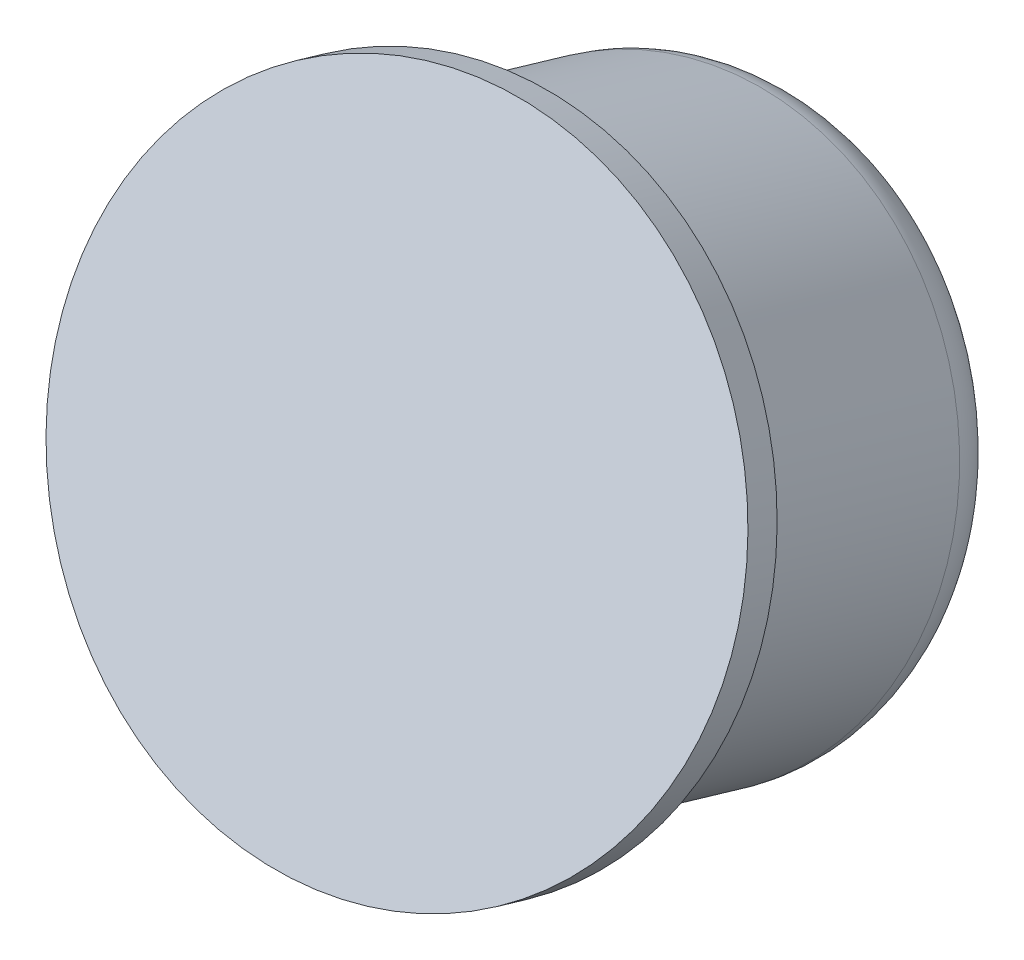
ISO-10303-21;
HEADER;
FILE_DESCRIPTION(('STEP AP214'),'2;1');
FILE_NAME('part.step','',(''),(''),'','','');
FILE_SCHEMA(('AUTOMOTIVE_DESIGN { 1 0 10303 214 1 1 1 1 }'));
ENDSEC;
DATA;
#1=APPLICATION_CONTEXT('core data for automotive mechanical design processes');
#2=APPLICATION_PROTOCOL_DEFINITION('international standard','automotive_design',2000,#1);
#3=PRODUCT_CONTEXT('',#1,'mechanical');
#4=PRODUCT('Part','Part','',(#3));
#5=PRODUCT_RELATED_PRODUCT_CATEGORY('part','',(#4));
#6=PRODUCT_DEFINITION_FORMATION('','',#4);
#7=PRODUCT_DEFINITION_CONTEXT('part definition',#1,'design');
#8=PRODUCT_DEFINITION('design','',#6,#7);
#9=PRODUCT_DEFINITION_SHAPE('','',#8);
#10=(LENGTH_UNIT() NAMED_UNIT(*) SI_UNIT(.MILLI.,.METRE.));
#11=(NAMED_UNIT(*) PLANE_ANGLE_UNIT() SI_UNIT($,.RADIAN.));
#12=(NAMED_UNIT(*) SI_UNIT($,.STERADIAN.) SOLID_ANGLE_UNIT());
#13=UNCERTAINTY_MEASURE_WITH_UNIT(LENGTH_MEASURE(1.E-05),#10,'distance_accuracy_value','');
#14=(GEOMETRIC_REPRESENTATION_CONTEXT(3) GLOBAL_UNCERTAINTY_ASSIGNED_CONTEXT((#13)) GLOBAL_UNIT_ASSIGNED_CONTEXT((#10,
#11,#12)) REPRESENTATION_CONTEXT('',''));
#15=CARTESIAN_POINT('',(0.,0.,0.));
#16=DIRECTION('',(0.,0.,1.));
#17=DIRECTION('',(1.,0.,0.));
#18=AXIS2_PLACEMENT_3D('',#15,#16,#17);
#19=CARTESIAN_POINT('',(-863.385749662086,-322.012171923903,-505.02655231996));
#20=DIRECTION('',(-0.0989674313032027,-0.344641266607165,-0.933502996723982));
#21=DIRECTION('',(0.,0.938108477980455,-0.346341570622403));
#22=AXIS2_PLACEMENT_3D('',#19,#20,#21);
#23=PLANE('',#22);
#24=CARTESIAN_POINT('',(-866.064593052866,-331.504800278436,-501.237952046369));
#25=CARTESIAN_POINT('',(-865.936292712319,-331.541083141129,-501.238158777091));
#26=CARTESIAN_POINT('',(-865.807359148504,-331.575119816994,-501.239261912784));
#27=CARTESIAN_POINT('',(-865.548401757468,-331.638639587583,-501.243264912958));
#28=CARTESIAN_POINT('',(-865.418377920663,-331.66812264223,-501.246164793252));
#29=CARTESIAN_POINT('',(-865.157416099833,-331.722473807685,-501.253765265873));
#30=CARTESIAN_POINT('',(-865.026478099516,-331.747341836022,-501.258465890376));
#31=CARTESIAN_POINT('',(-864.841903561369,-331.779099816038,-501.266309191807));
#32=CARTESIAN_POINT('',(-864.788557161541,-331.787893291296,-501.268718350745));
#33=CARTESIAN_POINT('',(-864.713059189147,-331.799727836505,-501.272353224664));
#34=CARTESIAN_POINT('',(-864.690956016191,-331.803118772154,-501.273444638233));
#35=CARTESIAN_POINT('',(-864.578207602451,-331.820064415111,-501.279141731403));
#36=CARTESIAN_POINT('',(-864.487420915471,-331.832551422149,-501.28415659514));
#37=CARTESIAN_POINT('',(-864.238408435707,-331.863711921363,-501.299052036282));
#38=CARTESIAN_POINT('',(-864.079947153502,-331.880133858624,-501.309788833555));
#39=CARTESIAN_POINT('',(-863.742939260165,-331.907816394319,-501.335297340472));
#40=CARTESIAN_POINT('',(-863.564344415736,-331.918181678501,-501.3504047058));
#41=CARTESIAN_POINT('',(-863.202680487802,-331.930503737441,-501.384198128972));
#42=CARTESIAN_POINT('',(-863.0196114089,-331.932243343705,-501.40296436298));
#43=CARTESIAN_POINT('',(-862.682942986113,-331.927187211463,-501.440523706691));
#44=CARTESIAN_POINT('',(-862.529269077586,-331.921699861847,-501.458841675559));
#45=CARTESIAN_POINT('',(-862.222562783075,-331.904374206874,-501.497754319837));
#46=CARTESIAN_POINT('',(-862.069530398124,-331.892535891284,-501.518348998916));
#47=CARTESIAN_POINT('',(-861.823770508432,-331.86837723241,-501.553322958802));
#48=CARTESIAN_POINT('',(-861.730744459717,-331.85803628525,-501.567003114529));
#49=CARTESIAN_POINT('',(-861.593619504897,-331.841012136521,-501.587825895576));
#50=CARTESIAN_POINT('',(-861.54935718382,-331.83524154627,-501.594648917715));
#51=CARTESIAN_POINT('',(-861.367947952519,-331.8104502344,-501.62303416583));
#52=CARTESIAN_POINT('',(-861.231239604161,-331.789087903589,-501.645414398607));
#53=CARTESIAN_POINT('',(-860.92537071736,-331.735278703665,-501.697707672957));
#54=CARTESIAN_POINT('',(-860.756547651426,-331.701397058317,-501.728114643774));
#55=CARTESIAN_POINT('',(-860.387933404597,-331.61818030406,-501.797917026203));
#56=CARTESIAN_POINT('',(-860.188639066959,-331.567113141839,-501.837899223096));
#57=CARTESIAN_POINT('',(-859.901039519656,-331.48449434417,-501.898891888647));
#58=CARTESIAN_POINT('',(-859.811126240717,-331.457367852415,-501.918439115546));
#59=CARTESIAN_POINT('',(-859.614879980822,-331.395309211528,-501.962156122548));
#60=CARTESIAN_POINT('',(-859.50873906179,-331.359882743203,-501.986488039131));
#61=CARTESIAN_POINT('',(-859.22456009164,-331.259988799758,-502.053495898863));
#62=CARTESIAN_POINT('',(-859.047820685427,-331.19244927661,-502.097168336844));
#63=CARTESIAN_POINT('',(-858.786161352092,-331.084245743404,-502.164856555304));
#64=CARTESIAN_POINT('',(-858.699512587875,-331.047026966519,-502.187783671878));
#65=CARTESIAN_POINT('',(-858.527417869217,-330.970315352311,-502.234349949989));
#66=CARTESIAN_POINT('',(-858.441971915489,-330.93082251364,-502.257989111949));
#67=CARTESIAN_POINT('',(-858.254605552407,-330.841095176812,-502.310979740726));
#68=CARTESIAN_POINT('',(-858.152978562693,-330.790342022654,-502.340491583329));
#69=CARTESIAN_POINT('',(-857.951693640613,-330.685612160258,-502.400496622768));
#70=CARTESIAN_POINT('',(-857.852035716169,-330.631635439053,-502.430989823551));
#71=CARTESIAN_POINT('',(-857.669688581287,-330.528900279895,-502.488250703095));
#72=CARTESIAN_POINT('',(-857.586708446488,-330.480583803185,-502.514886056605));
#73=CARTESIAN_POINT('',(-857.425399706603,-330.383554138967,-502.56781008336));
#74=CARTESIAN_POINT('',(-857.34701331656,-330.33492366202,-502.594074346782));
#75=CARTESIAN_POINT('',(-857.175540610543,-330.225244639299,-502.652745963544));
#76=CARTESIAN_POINT('',(-857.082802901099,-330.163723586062,-502.685290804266));
#77=CARTESIAN_POINT('',(-856.9043587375,-330.041000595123,-502.749517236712));
#78=CARTESIAN_POINT('',(-856.818536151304,-329.979945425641,-502.781156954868));
#79=CARTESIAN_POINT('',(-856.653657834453,-329.858646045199,-502.84341958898));
#80=CARTESIAN_POINT('',(-856.574487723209,-329.798537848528,-502.874004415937));
#81=CARTESIAN_POINT('',(-856.422644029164,-329.679593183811,-502.934015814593));
#82=CARTESIAN_POINT('',(-856.349858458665,-329.62088190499,-502.963408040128));
#83=CARTESIAN_POINT('',(-856.146381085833,-329.451864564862,-503.047379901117));
#84=CARTESIAN_POINT('',(-856.017850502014,-329.339240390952,-503.102586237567));
#85=CARTESIAN_POINT('',(-855.853333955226,-329.187303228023,-503.176121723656));
#86=CARTESIAN_POINT('',(-855.814420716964,-329.150769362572,-503.193735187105));
#87=CARTESIAN_POINT('',(-855.710732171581,-329.051812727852,-503.241261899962));
#88=CARTESIAN_POINT('',(-855.646545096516,-328.988838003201,-503.271316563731));
#89=CARTESIAN_POINT('',(-855.502808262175,-328.843818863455,-503.340094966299));
#90=CARTESIAN_POINT('',(-855.423842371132,-328.761257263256,-503.378947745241));
#91=CARTESIAN_POINT('',(-855.248284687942,-328.571036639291,-503.467787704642));
#92=CARTESIAN_POINT('',(-855.152644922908,-328.462584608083,-503.517966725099));
#93=CARTESIAN_POINT('',(-855.005850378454,-328.288247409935,-503.597893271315));
#94=CARTESIAN_POINT('',(-854.952939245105,-328.223691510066,-503.62733624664));
#95=CARTESIAN_POINT('',(-854.832305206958,-328.072447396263,-503.695963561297));
#96=CARTESIAN_POINT('',(-854.765248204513,-327.985274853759,-503.735256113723));
#97=CARTESIAN_POINT('',(-854.641183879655,-327.818024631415,-503.810156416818));
#98=CARTESIAN_POINT('',(-854.58385985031,-327.738160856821,-503.845718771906));
#99=CARTESIAN_POINT('',(-854.463548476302,-327.564828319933,-503.922466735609));
#100=CARTESIAN_POINT('',(-854.400976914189,-327.471093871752,-503.96370635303));
#101=CARTESIAN_POINT('',(-854.307142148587,-327.324984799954,-504.027596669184));
#102=CARTESIAN_POINT('',(-854.274662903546,-327.273325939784,-504.05011203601));
#103=CARTESIAN_POINT('',(-854.177714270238,-327.115738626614,-504.118570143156));
#104=CARTESIAN_POINT('',(-854.114861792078,-327.008880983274,-504.164684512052));
#105=CARTESIAN_POINT('',(-854.003674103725,-326.810906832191,-504.249562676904));
#106=CARTESIAN_POINT('',(-853.954667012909,-326.72014050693,-504.288268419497));
#107=CARTESIAN_POINT('',(-853.849550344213,-326.517464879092,-504.374238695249));
#108=CARTESIAN_POINT('',(-853.794172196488,-326.40519669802,-504.421558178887));
#109=CARTESIAN_POINT('',(-853.725055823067,-326.257564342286,-504.483390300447));
#110=CARTESIAN_POINT('',(-853.709194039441,-326.22313060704,-504.497784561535));
#111=CARTESIAN_POINT('',(-853.610703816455,-326.00578567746,-504.588468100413));
#112=CARTESIAN_POINT('',(-853.533894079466,-325.820318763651,-504.665084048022));
#113=CARTESIAN_POINT('',(-853.401513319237,-325.468444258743,-504.809027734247));
#114=CARTESIAN_POINT('',(-853.344486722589,-325.302564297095,-504.876314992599));
#115=CARTESIAN_POINT('',(-853.284401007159,-325.110403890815,-504.953629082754));
#116=CARTESIAN_POINT('',(-853.276734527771,-325.085521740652,-504.963628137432));
#117=CARTESIAN_POINT('',(-853.209083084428,-324.862613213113,-505.053096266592));
#118=CARTESIAN_POINT('',(-853.155625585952,-324.662565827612,-505.132619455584));
#119=CARTESIAN_POINT('',(-853.067946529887,-324.283739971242,-505.281774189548));
#120=CARTESIAN_POINT('',(-853.032177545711,-324.10532790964,-505.35143451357));
#121=CARTESIAN_POINT('',(-852.991395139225,-323.865002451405,-505.444484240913));
#122=CARTESIAN_POINT('',(-852.981666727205,-323.80393583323,-505.468060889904));
#123=CARTESIAN_POINT('',(-852.939580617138,-323.521424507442,-505.576823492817));
#124=CARTESIAN_POINT('',(-852.914661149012,-323.298677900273,-505.661701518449));
#125=CARTESIAN_POINT('',(-852.888242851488,-322.946826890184,-505.794402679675));
#126=CARTESIAN_POINT('',(-852.881289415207,-322.818240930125,-505.842612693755));
#127=CARTESIAN_POINT('',(-852.875546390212,-322.648584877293,-505.905857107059));
#128=CARTESIAN_POINT('',(-852.87442359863,-322.607659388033,-505.921085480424));
#129=CARTESIAN_POINT('',(-852.868453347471,-322.320899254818,-506.027587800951));
#130=CARTESIAN_POINT('',(-852.873081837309,-322.074459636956,-506.118080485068));
#131=CARTESIAN_POINT('',(-852.894345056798,-321.708722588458,-506.250853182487));
#132=CARTESIAN_POINT('',(-852.90357870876,-321.589235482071,-506.293987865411));
#133=CARTESIAN_POINT('',(-852.918251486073,-321.43739043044,-506.348492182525));
#134=CARTESIAN_POINT('',(-852.921560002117,-321.404922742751,-506.360128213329));
#135=CARTESIAN_POINT('',(-852.930493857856,-321.321587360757,-506.389947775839));
#136=CARTESIAN_POINT('',(-852.936368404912,-321.270734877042,-506.408099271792));
#137=CARTESIAN_POINT('',(-852.958969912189,-321.088087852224,-506.473134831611));
#138=CARTESIAN_POINT('',(-852.978070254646,-320.956470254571,-506.519701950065));
#139=CARTESIAN_POINT('',(-853.031028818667,-320.638693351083,-506.631407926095));
#140=CARTESIAN_POINT('',(-853.067715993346,-320.452846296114,-506.696131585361));
#141=CARTESIAN_POINT('',(-853.111475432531,-320.260962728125,-506.762334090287));
#142=CARTESIAN_POINT('',(-853.113083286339,-320.253948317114,-506.764753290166));
#143=CARTESIAN_POINT('',(-853.119516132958,-320.226025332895,-506.774380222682));
#144=CARTESIAN_POINT('',(-853.124402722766,-320.205127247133,-506.781577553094));
#145=CARTESIAN_POINT('',(-853.137510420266,-320.149903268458,-506.800576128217));
#146=CARTESIAN_POINT('',(-853.145851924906,-320.115598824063,-506.812356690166));
#147=CARTESIAN_POINT('',(-853.166257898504,-320.033636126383,-506.840453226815));
#148=CARTESIAN_POINT('',(-853.178500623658,-319.986011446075,-506.856737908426));
#149=CARTESIAN_POINT('',(-853.20727073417,-319.877526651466,-506.893739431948));
#150=CARTESIAN_POINT('',(-853.224034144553,-319.816714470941,-506.914413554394));
#151=CARTESIAN_POINT('',(-853.262576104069,-319.682028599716,-506.960052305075));
#152=CARTESIAN_POINT('',(-853.284647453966,-319.608219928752,-506.984961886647));
#153=CARTESIAN_POINT('',(-853.334700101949,-319.447785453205,-507.038886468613));
#154=CARTESIAN_POINT('',(-853.363029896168,-319.361245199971,-507.067832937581));
#155=CARTESIAN_POINT('',(-853.426651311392,-319.175680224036,-507.129596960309));
#156=CARTESIAN_POINT('',(-853.462345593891,-319.076765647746,-507.162331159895));
#157=CARTESIAN_POINT('',(-853.54189539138,-318.866893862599,-507.231380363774));
#158=CARTESIAN_POINT('',(-853.58620574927,-318.756076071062,-507.267595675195));
#159=CARTESIAN_POINT('',(-853.684321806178,-318.522972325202,-507.343253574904));
#160=CARTESIAN_POINT('',(-853.738631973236,-318.40086029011,-507.38257847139));
#161=CARTESIAN_POINT('',(-853.858199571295,-318.145901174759,-507.464030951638));
#162=CARTESIAN_POINT('',(-853.924007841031,-318.013268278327,-507.506021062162));
#163=CARTESIAN_POINT('',(-854.068120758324,-317.738185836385,-507.592300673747));
#164=CARTESIAN_POINT('',(-854.14701863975,-317.595996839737,-507.636431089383));
#165=CARTESIAN_POINT('',(-854.318927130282,-317.302938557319,-507.726400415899));
#166=CARTESIAN_POINT('',(-854.412568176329,-317.152383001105,-507.772056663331));
#167=CARTESIAN_POINT('',(-854.615627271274,-316.843957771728,-507.864396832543));
#168=CARTESIAN_POINT('',(-854.725707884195,-316.686460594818,-507.910872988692));
#169=CARTESIAN_POINT('',(-854.900710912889,-316.450268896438,-507.979519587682));
#170=CARTESIAN_POINT('',(-854.962407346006,-316.369486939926,-508.00280270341));
#171=CARTESIAN_POINT('',(-855.090444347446,-316.206797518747,-508.049292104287));
#172=CARTESIAN_POINT('',(-855.156871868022,-316.124949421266,-508.072467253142));
#173=CARTESIAN_POINT('',(-855.294567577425,-315.960388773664,-508.118623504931));
#174=CARTESIAN_POINT('',(-855.365923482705,-315.877740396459,-508.141571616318));
#175=CARTESIAN_POINT('',(-855.513668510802,-315.711856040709,-508.187151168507));
#176=CARTESIAN_POINT('',(-855.590145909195,-315.628689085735,-508.209747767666));
#177=CARTESIAN_POINT('',(-855.74831688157,-315.46206649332,-508.254494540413));
#178=CARTESIAN_POINT('',(-855.830098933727,-315.378684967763,-508.276607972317));
#179=CARTESIAN_POINT('',(-855.999051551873,-315.211953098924,-508.32025204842));
#180=CARTESIAN_POINT('',(-856.086310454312,-315.128682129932,-508.341744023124));
#181=CARTESIAN_POINT('',(-856.266376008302,-314.962513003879,-508.384002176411));
#182=CARTESIAN_POINT('',(-856.359270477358,-314.879699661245,-508.404727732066));
#183=CARTESIAN_POINT('',(-856.55075106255,-314.714809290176,-508.445303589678));
#184=CARTESIAN_POINT('',(-856.649424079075,-314.632822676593,-508.46511129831));
#185=CARTESIAN_POINT('',(-856.852587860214,-314.469971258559,-508.503695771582));
#186=CARTESIAN_POINT('',(-856.957164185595,-314.389202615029,-508.522427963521));
#187=CARTESIAN_POINT('',(-857.172240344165,-314.229194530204,-508.558699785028));
#188=CARTESIAN_POINT('',(-857.282823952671,-314.15005712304,-508.576192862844));
#189=CARTESIAN_POINT('',(-857.509997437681,-313.993740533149,-508.609819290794));
#190=CARTESIAN_POINT('',(-857.626668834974,-313.916669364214,-508.625904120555));
#191=CARTESIAN_POINT('',(-857.866074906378,-313.764935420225,-508.656541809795));
#192=CARTESIAN_POINT('',(-857.988888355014,-313.690386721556,-508.671044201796));
#193=CARTESIAN_POINT('',(-858.240606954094,-313.544168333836,-508.698340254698));
#194=CARTESIAN_POINT('',(-858.369587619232,-313.472618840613,-508.711081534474));
#195=CARTESIAN_POINT('',(-858.633637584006,-313.332888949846,-508.734674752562));
#196=CARTESIAN_POINT('',(-858.768778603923,-313.264834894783,-508.74547244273));
#197=CARTESIAN_POINT('',(-859.045111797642,-313.132604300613,-508.764994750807));
#198=CARTESIAN_POINT('',(-859.186371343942,-313.068560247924,-508.773663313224));
#199=CARTESIAN_POINT('',(-859.474866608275,-312.944874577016,-508.788741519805));
#200=CARTESIAN_POINT('',(-859.622164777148,-312.885371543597,-508.795093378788));
#201=CARTESIAN_POINT('',(-859.92262225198,-312.771308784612,-508.805350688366));
#202=CARTESIAN_POINT('',(-860.075838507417,-312.716893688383,-508.809196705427));
#203=CARTESIAN_POINT('',(-860.387972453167,-312.613556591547,-508.814256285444));
#204=CARTESIAN_POINT('',(-860.546940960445,-312.564785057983,-508.815408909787));
#205=CARTESIAN_POINT('',(-860.706906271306,-312.51954356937,-508.815152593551));
#206=B_SPLINE_CURVE_WITH_KNOTS('',3,(#24,#25,#26,#27,#28,#29,#30,#31,#32,#33,#34,#35,#36,#37,
#38,#39,#40,#41,#42,#43,#44,#45,#46,#47,#48,#49,#50,#51,#52,#53,#54,#55,#56,#57,#58,#59,#60,#61,
#62,#63,#64,#65,#66,#67,#68,#69,#70,#71,#72,#73,#74,#75,#76,#77,#78,#79,#80,#81,#82,#83,#84,#85,
#86,#87,#88,#89,#90,#91,#92,#93,#94,#95,#96,#97,#98,#99,#100,#101,#102,#103,#104,#105,#106,#107,
#108,#109,#110,#111,#112,#113,#114,#115,#116,#117,#118,#119,#120,#121,#122,#123,#124,#125,#126,
#127,#128,#129,#130,#131,#132,#133,#134,#135,#136,#137,#138,#139,#140,#141,#142,#143,#144,#145,
#146,#147,#148,#149,#150,#151,#152,#153,#154,#155,#156,#157,#158,#159,#160,#161,#162,#163,#164,
#165,#166,#167,#168,#169,#170,#171,#172,#173,#174,#175,#176,#177,#178,#179,#180,#181,#182,#183,
#184,#185,#186,#187,#188,#189,#190,#191,#192,#193,#194,#195,#196,#197,#198,#199,#200,#201,#202,
#203,#204,#205),.UNSPECIFIED.,.F.,.F.,(4,2,2,2,2,2,2,2,2,2,2,2,2,2,2,2,2,2,2,2,2,2,2,2,2,2,2,2,
2,2,2,2,2,2,2,2,2,2,2,2,2,2,2,2,2,2,2,2,2,2,2,2,2,2,2,2,2,2,2,2,2,2,2,2,2,2,2,2,2,2,2,2,2,2,2,2,
2,2,2,2,2,2,2,2,2,2,2,2,2,2,4),(0.,0.399971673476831,0.799946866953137,1.19992920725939,
1.36228336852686,1.42944811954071,1.70475245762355,2.18359531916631,2.72196005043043,
3.27381269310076,3.73824925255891,4.20268656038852,4.4864337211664,4.62189758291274,
5.04227086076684,5.56662858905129,6.19495493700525,6.48271323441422,6.82619530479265,
7.40839030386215,7.69951488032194,7.9906396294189,8.34267317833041,8.69470814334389,
8.99361128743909,9.28131382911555,9.62909671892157,9.95896685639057,10.2709234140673,
10.5649656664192,11.1034428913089,11.2720604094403,11.5564547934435,11.9184032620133,
12.3774142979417,12.6429205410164,12.9932152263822,13.3067981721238,13.6667449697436,
13.861864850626,14.2585684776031,14.5890464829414,14.9904140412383,15.1120705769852,
15.7562047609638,16.319537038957,16.4032090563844,17.0681405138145,17.6523452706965,
17.8508786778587,18.5691999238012,18.9816145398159,19.1126591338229,19.899441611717,
20.2814874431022,20.3854301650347,20.5483648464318,20.9709988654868,21.5711574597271,
21.5939337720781,21.6618426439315,21.7734937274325,21.9288865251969,22.1280203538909,
22.3708943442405,22.6575074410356,22.9878584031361,23.3619458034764,23.7797680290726,
24.2413232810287,24.7466095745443,25.2956247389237,25.8883664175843,26.201168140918,
26.5249042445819,26.8595746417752,27.205179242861,27.5617179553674,27.9291906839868,
28.3075973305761,28.6969377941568,29.0972119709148,29.5084197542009,29.93056103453,
30.3636356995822,30.8076436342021,31.2625847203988,31.7284588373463,32.2052658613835,
32.6930056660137,33.1916781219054),.UNSPECIFIED.);
#207=CARTESIAN_POINT('',(-866.064593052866,-331.504800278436,-501.237952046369));
#208=VERTEX_POINT('',#207);
#209=CARTESIAN_POINT('',(-860.706906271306,-312.51954356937,-508.815152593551));
#210=VERTEX_POINT('',#209);
#211=EDGE_CURVE('E43',#208,#210,#206,.T.);
#212=ORIENTED_EDGE('',*,*,#211,.F.);
#213=CARTESIAN_POINT('',(-863.385749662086,-322.012171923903,-505.02655231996));
#214=DIRECTION('',(0.0989674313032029,0.344641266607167,0.933502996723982));
#215=DIRECTION('',(0.,-0.938108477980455,0.346341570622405));
#216=AXIS2_PLACEMENT_3D('',#213,#214,#215);
#217=CIRCLE('',#216,10.5659683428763);
#218=EDGE_CURVE('E21',#210,#208,#217,.T.);
#219=ORIENTED_EDGE('',*,*,#218,.F.);
#220=EDGE_LOOP('',(#212,#219));
#221=FACE_BOUND('',#220,.T.);
#222=ADVANCED_FACE('F17',(#221),#23,.T.);
#223=CARTESIAN_POINT('',(-862.75730647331,-319.823699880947,-499.098808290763));
#224=DIRECTION('',(0.0989674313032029,0.344641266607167,0.933502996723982));
#225=DIRECTION('',(0.,-0.938108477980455,0.346341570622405));
#226=AXIS2_PLACEMENT_3D('',#223,#224,#225);
#227=TOROIDAL_SURFACE('',#226,10.5659683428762,6.34999999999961);
#228=ORIENTED_EDGE('',*,*,#211,.T.);
#229=ORIENTED_EDGE('',*,*,#218,.T.);
#230=EDGE_LOOP('',(#228,#229));
#231=FACE_BOUND('',#230,.T.);
#232=CARTESIAN_POINT('',(-863.31940314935,-321.78112878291,-504.400743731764));
#233=DIRECTION('',(0.0989674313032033,0.34464126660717,0.93350299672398));
#234=DIRECTION('',(0.,-0.938108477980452,0.346341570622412));
#235=AXIS2_PLACEMENT_3D('',#232,#233,#234);
#236=CIRCLE('',#235,13.405774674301);
#237=CARTESIAN_POINT('',(-863.31940314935,-334.357199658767,-499.757766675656));
#238=VERTEX_POINT('',#237);
#239=EDGE_CURVE('E49',#238,#238,#236,.T.);
#240=ORIENTED_EDGE('',*,*,#239,.F.);
#241=EDGE_LOOP('',(#240));
#242=FACE_BOUND('',#241,.T.);
#243=ADVANCED_FACE('F46',(#231,#242),#227,.T.);
#244=CARTESIAN_POINT('',(-862.931003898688,-320.428578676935,-500.737196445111));
#245=DIRECTION('',(0.0989674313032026,0.344641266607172,0.93350299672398));
#246=DIRECTION('',(0.,-0.938108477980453,0.34634157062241));
#247=AXIS2_PLACEMENT_3D('',#244,#245,#246);
#248=CONICAL_SURFACE('',#247,21.2548063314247,1.10714871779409);
#249=CARTESIAN_POINT('',(-862.931003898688,-320.428578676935,-500.737196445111));
#250=DIRECTION('',(0.0989674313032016,0.344641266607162,0.933502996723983));
#251=DIRECTION('',(0.,-0.938108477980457,0.3463415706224));
#252=AXIS2_PLACEMENT_3D('',#249,#250,#251);
#253=CIRCLE('',#252,21.2548063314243);
#254=CARTESIAN_POINT('',(-862.931003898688,-340.367892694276,-493.375773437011));
#255=VERTEX_POINT('',#254);
#256=EDGE_CURVE('E51',#255,#255,#253,.T.);
#257=ORIENTED_EDGE('',*,*,#256,.F.);
#258=EDGE_LOOP('',(#257));
#259=FACE_BOUND('',#258,.T.);
#260=ORIENTED_EDGE('',*,*,#239,.T.);
#261=EDGE_LOOP('',(#260));
#262=FACE_BOUND('',#261,.T.);
#263=ADVANCED_FACE('F71',(#259,#262),#248,.T.);
#264=CARTESIAN_POINT('',(-862.368907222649,-318.471149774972,-495.43526100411));
#265=DIRECTION('',(-0.0989674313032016,-0.344641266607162,-0.933502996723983));
#266=DIRECTION('',(0.,0.938108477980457,-0.3463415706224));
#267=AXIS2_PLACEMENT_3D('',#264,#265,#266);
#268=TOROIDAL_SURFACE('',#267,18.4149999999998,6.35000000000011);
#269=ORIENTED_EDGE('',*,*,#256,.T.);
#270=EDGE_LOOP('',(#269));
#271=FACE_BOUND('',#270,.T.);
#272=CARTESIAN_POINT('',(-862.368907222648,-318.471149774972,-495.435261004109));
#273=DIRECTION('',(0.0989674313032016,0.344641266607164,0.933502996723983));
#274=DIRECTION('',(0.,-0.938108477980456,0.346341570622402));
#275=AXIS2_PLACEMENT_3D('',#272,#273,#274);
#276=CIRCLE('',#275,24.765);
#277=CARTESIAN_POINT('',(-862.368907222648,-341.703406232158,-486.858112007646));
#278=VERTEX_POINT('',#277);
#279=EDGE_CURVE('E56',#278,#278,#276,.T.);
#280=ORIENTED_EDGE('',*,*,#279,.F.);
#281=EDGE_LOOP('',(#280));
#282=FACE_BOUND('',#281,.T.);
#283=ADVANCED_FACE('F72',(#271,#282),#268,.T.);
#284=CARTESIAN_POINT('',(-862.368907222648,-318.471149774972,-495.435261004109));
#285=DIRECTION('',(0.0989674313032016,0.344641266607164,0.933502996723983));
#286=DIRECTION('',(0.,-0.938108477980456,0.346341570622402));
#287=AXIS2_PLACEMENT_3D('',#284,#285,#286);
#288=CYLINDRICAL_SURFACE('',#287,24.765);
#289=CARTESIAN_POINT('',(-860.142982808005,-310.719656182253,-474.439393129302));
#290=DIRECTION('',(0.0989674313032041,0.344641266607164,0.933502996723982));
#291=DIRECTION('',(0.,-0.938108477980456,0.346341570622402));
#292=AXIS2_PLACEMENT_3D('',#289,#290,#291);
#293=CIRCLE('',#292,24.765);
#294=CARTESIAN_POINT('',(-860.142982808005,-333.951912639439,-465.862244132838));
#295=VERTEX_POINT('',#294);
#296=EDGE_CURVE('E112',#295,#295,#293,.T.);
#297=ORIENTED_EDGE('',*,*,#296,.F.);
#298=EDGE_LOOP('',(#297));
#299=FACE_BOUND('',#298,.T.);
#300=ORIENTED_EDGE('',*,*,#279,.T.);
#301=EDGE_LOOP('',(#300));
#302=FACE_BOUND('',#301,.T.);
#303=ADVANCED_FACE('F74',(#299,#302),#288,.T.);
#304=CARTESIAN_POINT('',(-860.142982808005,-310.719656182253,-474.439393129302));
#305=DIRECTION('',(0.0989674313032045,0.344641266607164,0.933502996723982));
#306=DIRECTION('',(0.,-0.938108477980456,0.346341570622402));
#307=AXIS2_PLACEMENT_3D('',#304,#305,#306);
#308=TOROIDAL_SURFACE('',#307,26.2890000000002,1.52400000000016);
#309=CARTESIAN_POINT('',(-853.32697331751,-286.575981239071,-482.443084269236));
#310=CARTESIAN_POINT('',(-855.013120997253,-286.099072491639,-482.440394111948));
#311=CARTESIAN_POINT('',(-856.743912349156,-285.835232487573,-482.354307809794));
#312=CARTESIAN_POINT('',(-858.702327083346,-285.536693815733,-482.256899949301));
#313=CARTESIAN_POINT('',(-860.676627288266,-285.517355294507,-482.054729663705));
#314=CARTESIAN_POINT('',(-862.901655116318,-285.495560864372,-481.826884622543));
#315=CARTESIAN_POINT('',(-865.086005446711,-285.829082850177,-481.47217233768));
#316=CARTESIAN_POINT('',(-867.529256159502,-286.202135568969,-481.075417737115));
#317=CARTESIAN_POINT('',(-869.837967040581,-287.006747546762,-480.533598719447));
#318=CARTESIAN_POINT('',(-872.388709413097,-287.895710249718,-479.934978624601));
#319=CARTESIAN_POINT('',(-874.66864882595,-289.273833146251,-479.18447458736));
#320=CARTESIAN_POINT('',(-877.143126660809,-290.769545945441,-478.369932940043));
#321=CARTESIAN_POINT('',(-879.176124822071,-292.766741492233,-477.417052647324));
#322=CARTESIAN_POINT('',(-881.33161851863,-294.88427533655,-476.406757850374));
#323=CARTESIAN_POINT('',(-882.869734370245,-297.445932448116,-475.297949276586));
#324=CARTESIAN_POINT('',(-884.455405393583,-300.086790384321,-474.154858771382));
#325=CARTESIAN_POINT('',(-885.288751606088,-303.039552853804,-472.976375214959));
#326=CARTESIAN_POINT('',(-886.121829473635,-305.991364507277,-471.798271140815));
#327=CARTESIAN_POINT('',(-886.151055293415,-309.073472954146,-470.657284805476));
#328=CARTESIAN_POINT('',(-886.179386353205,-312.061221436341,-469.551230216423));
#329=CARTESIAN_POINT('',(-885.449238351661,-314.995863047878,-468.545194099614));
#330=CARTESIAN_POINT('',(-884.761041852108,-317.761891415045,-467.59696095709));
#331=CARTESIAN_POINT('',(-883.433821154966,-320.333701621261,-466.78817908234));
#332=CARTESIAN_POINT('',(-882.211818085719,-322.701627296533,-466.043514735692));
#333=CARTESIAN_POINT('',(-880.502260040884,-324.796254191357,-465.451439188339));
#334=CARTESIAN_POINT('',(-878.956117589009,-326.690657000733,-464.915959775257));
#335=CARTESIAN_POINT('',(-877.068357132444,-328.289202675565,-464.525925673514));
#336=CARTESIAN_POINT('',(-875.382210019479,-329.717023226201,-464.177547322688));
#337=CARTESIAN_POINT('',(-873.473778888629,-330.864763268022,-463.956138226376));
#338=CARTESIAN_POINT('',(-871.782393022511,-331.881971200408,-463.759909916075));
#339=CARTESIAN_POINT('',(-869.95631075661,-332.654090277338,-463.66844644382));
#340=CARTESIAN_POINT('',(-868.344071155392,-333.335790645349,-463.58769376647));
#341=CARTESIAN_POINT('',(-866.657339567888,-333.812864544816,-463.590384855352));
#342=B_SPLINE_CURVE_WITH_KNOTS('',2,(#309,#310,#311,#312,#313,#314,#315,#316,#317,#318,#319,
#320,#321,#322,#323,#324,#325,#326,#327,#328,#329,#330,#331,#332,#333,#334,#335,#336,#337,#338,
#339,#340,#341),.UNSPECIFIED.,.F.,.F.,(3,2,2,2,2,2,2,2,2,2,2,2,2,2,2,2,3),(0.,0.0625,0.125,
0.1875,0.25,0.3125,0.375,0.4375,0.5,0.5625,0.625,0.6875,0.75,0.8125,0.875,0.9375,1.),.UNSPECIFIED.);
#343=CARTESIAN_POINT('',(-853.32697331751,-286.575981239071,-482.443084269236));
#344=VERTEX_POINT('',#343);
#345=CARTESIAN_POINT('',(-866.657339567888,-333.812864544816,-463.590384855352));
#346=VERTEX_POINT('',#345);
#347=EDGE_CURVE('E109',#344,#346,#342,.T.);
#348=ORIENTED_EDGE('',*,*,#347,.F.);
#349=CARTESIAN_POINT('',(-866.657339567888,-333.812864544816,-463.590384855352));
#350=CARTESIAN_POINT('',(-864.971191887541,-334.289773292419,-463.593075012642));
#351=CARTESIAN_POINT('',(-863.240400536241,-334.553613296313,-463.679161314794));
#352=CARTESIAN_POINT('',(-861.281985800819,-334.852151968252,-463.776569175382));
#353=CARTESIAN_POINT('',(-859.307685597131,-334.87149048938,-463.978739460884));
#354=CARTESIAN_POINT('',(-857.082657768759,-334.89328491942,-464.206584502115));
#355=CARTESIAN_POINT('',(-854.898307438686,-334.55976293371,-464.561296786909));
#356=CARTESIAN_POINT('',(-852.455056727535,-334.186710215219,-464.958051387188));
#357=CARTESIAN_POINT('',(-850.146345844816,-333.382098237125,-465.499870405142));
#358=CARTESIAN_POINT('',(-847.595603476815,-332.493135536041,-466.098490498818));
#359=CARTESIAN_POINT('',(-845.315664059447,-331.115012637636,-466.848994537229));
#360=CARTESIAN_POINT('',(-842.841186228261,-329.619299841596,-467.663536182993));
#361=CARTESIAN_POINT('',(-840.808188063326,-327.622104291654,-468.616416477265));
#362=CARTESIAN_POINT('',(-838.652694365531,-325.504570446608,-469.626711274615));
#363=CARTESIAN_POINT('',(-837.114578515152,-322.94291333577,-470.735519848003));
#364=CARTESIAN_POINT('',(-835.528907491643,-320.302055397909,-471.878610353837));
#365=CARTESIAN_POINT('',(-834.695561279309,-317.349292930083,-473.05709390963));
#366=CARTESIAN_POINT('',(-833.86248341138,-314.397481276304,-474.235197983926));
#367=CARTESIAN_POINT('',(-833.833257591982,-311.315372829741,-475.376184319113));
#368=CARTESIAN_POINT('',(-833.80492653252,-308.327624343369,-476.482238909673));
#369=CARTESIAN_POINT('',(-834.535074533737,-305.392982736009,-477.488275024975));
#370=CARTESIAN_POINT('',(-835.223271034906,-302.62695436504,-478.436508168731));
#371=CARTESIAN_POINT('',(-836.550491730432,-300.055144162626,-479.245290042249));
#372=CARTESIAN_POINT('',(-837.772494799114,-297.687218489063,-479.989954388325));
#373=CARTESIAN_POINT('',(-839.482052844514,-295.592591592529,-480.582029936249));
#374=CARTESIAN_POINT('',(-841.028195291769,-293.698188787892,-481.117509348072));
#375=CARTESIAN_POINT('',(-842.915955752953,-292.099643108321,-481.507543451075));
#376=CARTESIAN_POINT('',(-844.6021028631,-290.671822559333,-481.855921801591));
#377=CARTESIAN_POINT('',(-846.510533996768,-289.524082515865,-482.077330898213));
#378=CARTESIAN_POINT('',(-848.201919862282,-288.506874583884,-482.273559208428));
#379=CARTESIAN_POINT('',(-850.028002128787,-287.734755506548,-482.365022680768));
#380=CARTESIAN_POINT('',(-851.640241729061,-287.053055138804,-482.44577535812));
#381=CARTESIAN_POINT('',(-853.32697331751,-286.575981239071,-482.443084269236));
#382=B_SPLINE_CURVE_WITH_KNOTS('',2,(#349,#350,#351,#352,#353,#354,#355,#356,#357,#358,#359,
#360,#361,#362,#363,#364,#365,#366,#367,#368,#369,#370,#371,#372,#373,#374,#375,#376,#377,#378,
#379,#380,#381),.UNSPECIFIED.,.F.,.F.,(3,2,2,2,2,2,2,2,2,2,2,2,2,2,2,2,3),(0.,0.0625,0.125,
0.1875,0.25,0.3125,0.375,0.4375,0.5,0.5625,0.625,0.6875,0.75,0.8125,0.875,0.9375,1.),.UNSPECIFIED.);
#383=EDGE_CURVE('E35',#346,#344,#382,.T.);
#384=ORIENTED_EDGE('',*,*,#383,.F.);
#385=EDGE_LOOP('',(#348,#384));
#386=FACE_BOUND('',#385,.T.);
#387=ORIENTED_EDGE('',*,*,#296,.T.);
#388=EDGE_LOOP('',(#387));
#389=FACE_BOUND('',#388,.T.);
#390=ADVANCED_FACE('F19',(#386,#389),#308,.F.);
#391=CARTESIAN_POINT('',(-859.992156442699,-310.194422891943,-473.016734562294));
#392=DIRECTION('',(-0.0989674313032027,-0.344641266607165,-0.933502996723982));
#393=DIRECTION('',(0.,0.938108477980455,-0.346341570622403));
#394=AXIS2_PLACEMENT_3D('',#391,#392,#393);
#395=PLANE('',#394);
#396=ORIENTED_EDGE('',*,*,#347,.T.);
#397=ORIENTED_EDGE('',*,*,#383,.T.);
#398=EDGE_LOOP('',(#396,#397));
#399=FACE_BOUND('',#398,.T.);
#400=CARTESIAN_POINT('',(-859.992156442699,-310.194422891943,-473.016734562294));
#401=DIRECTION('',(0.0989674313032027,0.344641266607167,0.933502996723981));
#402=DIRECTION('',(0.,-0.938108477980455,0.346341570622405));
#403=AXIS2_PLACEMENT_3D('',#400,#401,#402);
#404=CIRCLE('',#403,27.0510000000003);
#405=CARTESIAN_POINT('',(-859.992156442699,-335.571195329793,-463.647848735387));
#406=VERTEX_POINT('',#405);
#407=EDGE_CURVE('E119',#406,#406,#404,.T.);
#408=ORIENTED_EDGE('',*,*,#407,.F.);
#409=EDGE_LOOP('',(#408));
#410=FACE_BOUND('',#409,.T.);
#411=ADVANCED_FACE('F99',(#399,#410),#395,.T.);
#412=CARTESIAN_POINT('',(-859.841330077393,-309.669189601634,-471.594075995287));
#413=DIRECTION('',(0.0989674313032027,0.344641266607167,0.933502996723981));
#414=DIRECTION('',(0.,-0.938108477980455,0.346341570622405));
#415=AXIS2_PLACEMENT_3D('',#412,#413,#414);
#416=CONICAL_SURFACE('',#415,28.5750000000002,0.785398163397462);
#417=CARTESIAN_POINT('',(-859.841330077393,-309.669189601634,-471.594075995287));
#418=DIRECTION('',(0.0989674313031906,0.344641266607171,0.933502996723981));
#419=DIRECTION('',(0.,-0.938108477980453,0.346341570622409));
#420=AXIS2_PLACEMENT_3D('',#417,#418,#419);
#421=CIRCLE('',#420,28.575);
#422=CARTESIAN_POINT('',(-859.841330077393,-336.475639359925,-461.697365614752));
#423=VERTEX_POINT('',#422);
#424=EDGE_CURVE('E27',#423,#423,#421,.T.);
#425=ORIENTED_EDGE('',*,*,#424,.F.);
#426=EDGE_LOOP('',(#425));
#427=FACE_BOUND('',#426,.T.);
#428=ORIENTED_EDGE('',*,*,#407,.T.);
#429=EDGE_LOOP('',(#428));
#430=FACE_BOUND('',#429,.T.);
#431=ADVANCED_FACE('F93',(#427,#430),#416,.T.);
#432=CARTESIAN_POINT('',(-859.841330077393,-309.669189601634,-471.594075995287));
#433=DIRECTION('',(0.0989674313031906,0.344641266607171,0.933502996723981));
#434=DIRECTION('',(0.,-0.938108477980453,0.346341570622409));
#435=AXIS2_PLACEMENT_3D('',#432,#433,#434);
#436=CYLINDRICAL_SURFACE('',#435,28.575);
#437=CARTESIAN_POINT('',(-859.51956716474,-308.548691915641,-468.559071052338));
#438=DIRECTION('',(0.0989674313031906,0.344641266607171,0.933502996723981));
#439=DIRECTION('',(0.,-0.938108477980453,0.346341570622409));
#440=AXIS2_PLACEMENT_3D('',#437,#438,#439);
#441=CIRCLE('',#440,28.575);
#442=CARTESIAN_POINT('',(-859.51956716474,-335.355141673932,-458.662360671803));
#443=VERTEX_POINT('',#442);
#444=EDGE_CURVE('E11',#443,#443,#441,.T.);
#445=ORIENTED_EDGE('',*,*,#444,.F.);
#446=EDGE_LOOP('',(#445));
#447=FACE_BOUND('',#446,.T.);
#448=ORIENTED_EDGE('',*,*,#424,.T.);
#449=EDGE_LOOP('',(#448));
#450=FACE_BOUND('',#449,.T.);
#451=ADVANCED_FACE('F87',(#447,#450),#436,.T.);
#452=CARTESIAN_POINT('',(-859.519567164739,-308.548691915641,-468.559071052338));
#453=DIRECTION('',(0.0989674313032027,0.344641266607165,0.933502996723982));
#454=DIRECTION('',(0.,-0.938108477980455,0.346341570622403));
#455=AXIS2_PLACEMENT_3D('',#452,#453,#454);
#456=PLANE('',#455);
#457=ORIENTED_EDGE('',*,*,#444,.T.);
#458=EDGE_LOOP('',(#457));
#459=FACE_BOUND('',#458,.T.);
#460=ADVANCED_FACE('F85',(#459),#456,.T.);
#461=CLOSED_SHELL('',(#222,#243,#263,#283,#303,#390,#411,#431,#451,#460));
#462=MANIFOLD_SOLID_BREP('B1',#461);
#463=ADVANCED_BREP_SHAPE_REPRESENTATION('',(#18,#462),#14);
#464=SHAPE_DEFINITION_REPRESENTATION(#9,#463);
ENDSEC;
END-ISO-10303-21;
